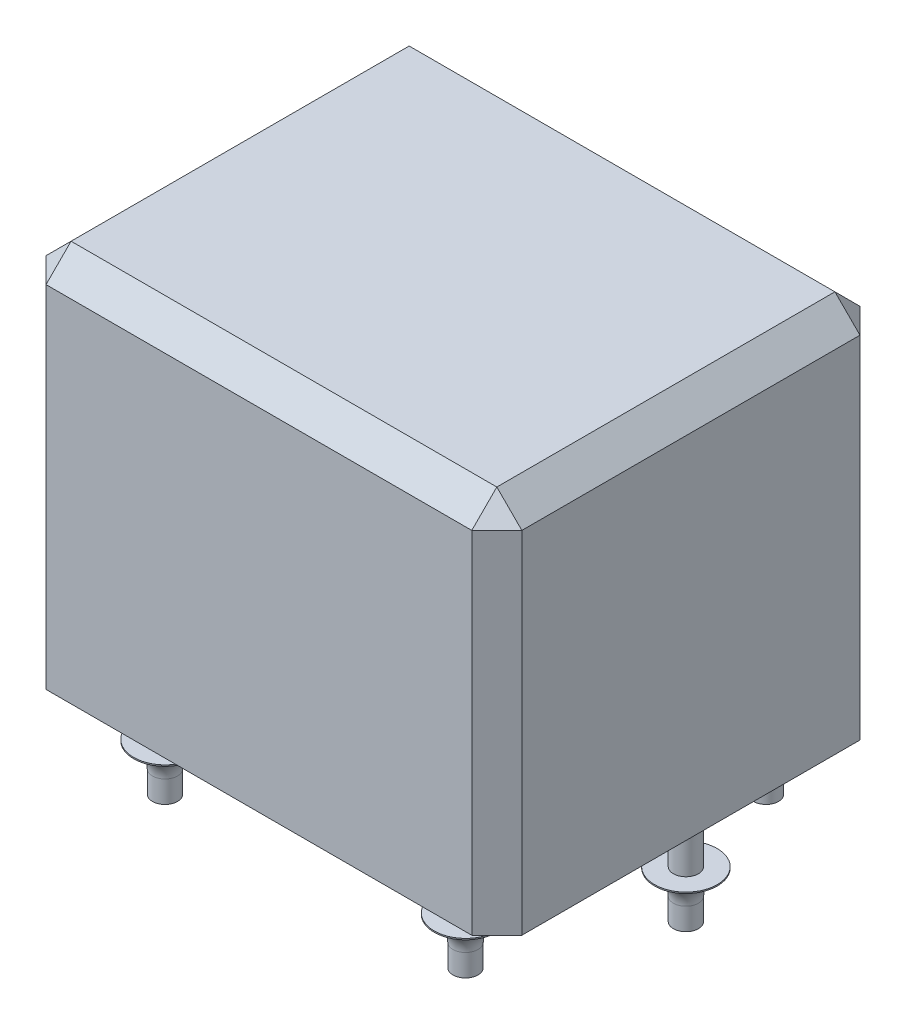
ISO-10303-21;
HEADER;
FILE_DESCRIPTION(('STEP AP214'),'2;1');
FILE_NAME('part.step','',(''),(''),'','','');
FILE_SCHEMA(('AUTOMOTIVE_DESIGN { 1 0 10303 214 1 1 1 1 }'));
ENDSEC;
DATA;
#1=APPLICATION_CONTEXT('core data for automotive mechanical design processes');
#2=APPLICATION_PROTOCOL_DEFINITION('international standard','automotive_design',2000,#1);
#3=PRODUCT_CONTEXT('',#1,'mechanical');
#4=PRODUCT('Part','Part','',(#3));
#5=PRODUCT_RELATED_PRODUCT_CATEGORY('part','',(#4));
#6=PRODUCT_DEFINITION_FORMATION('','',#4);
#7=PRODUCT_DEFINITION_CONTEXT('part definition',#1,'design');
#8=PRODUCT_DEFINITION('design','',#6,#7);
#9=PRODUCT_DEFINITION_SHAPE('','',#8);
#10=(LENGTH_UNIT() NAMED_UNIT(*) SI_UNIT(.MILLI.,.METRE.));
#11=(NAMED_UNIT(*) PLANE_ANGLE_UNIT() SI_UNIT($,.RADIAN.));
#12=(NAMED_UNIT(*) SI_UNIT($,.STERADIAN.) SOLID_ANGLE_UNIT());
#13=UNCERTAINTY_MEASURE_WITH_UNIT(LENGTH_MEASURE(1.E-05),#10,'distance_accuracy_value','');
#14=(GEOMETRIC_REPRESENTATION_CONTEXT(3) GLOBAL_UNCERTAINTY_ASSIGNED_CONTEXT((#13)) GLOBAL_UNIT_ASSIGNED_CONTEXT((#10,
#11,#12)) REPRESENTATION_CONTEXT('',''));
#15=CARTESIAN_POINT('',(0.,0.,0.));
#16=DIRECTION('',(0.,0.,1.));
#17=DIRECTION('',(1.,0.,0.));
#18=AXIS2_PLACEMENT_3D('',#15,#16,#17);
#19=CARTESIAN_POINT('',(8.8,-3.5,-0.5));
#20=DIRECTION('',(0.,1.,0.));
#21=DIRECTION('',(0.,0.,1.));
#22=AXIS2_PLACEMENT_3D('',#19,#20,#21);
#23=CYLINDRICAL_SURFACE('',#22,0.500000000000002);
#24=CARTESIAN_POINT('',(8.8,-2.61824583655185,-0.5));
#25=DIRECTION('',(0.,1.,0.));
#26=DIRECTION('',(0.,0.,1.));
#27=AXIS2_PLACEMENT_3D('',#24,#25,#26);
#28=CIRCLE('',#27,0.500000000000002);
#29=CARTESIAN_POINT('',(8.8,-2.61824583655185,0.));
#30=VERTEX_POINT('',#29);
#31=EDGE_CURVE('E11',#30,#30,#28,.F.);
#32=ORIENTED_EDGE('',*,*,#31,.T.);
#33=EDGE_LOOP('',(#32));
#34=FACE_BOUND('',#33,.T.);
#35=CARTESIAN_POINT('',(8.8,-3.5,-0.5));
#36=DIRECTION('',(0.,-1.,0.));
#37=DIRECTION('',(0.,0.,-1.));
#38=AXIS2_PLACEMENT_3D('',#35,#36,#37);
#39=CIRCLE('',#38,0.500000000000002);
#40=CARTESIAN_POINT('',(8.8,-3.5,-1.));
#41=VERTEX_POINT('',#40);
#42=EDGE_CURVE('E48',#41,#41,#39,.T.);
#43=ORIENTED_EDGE('',*,*,#42,.F.);
#44=EDGE_LOOP('',(#43));
#45=FACE_BOUND('',#44,.T.);
#46=ADVANCED_FACE('F41',(#34,#45),#23,.T.);
#47=CARTESIAN_POINT('',(8.8,-3.5,-0.5));
#48=DIRECTION('',(0.,-1.,0.));
#49=DIRECTION('',(0.,0.,-1.));
#50=AXIS2_PLACEMENT_3D('',#47,#48,#49);
#51=PLANE('',#50);
#52=ORIENTED_EDGE('',*,*,#42,.T.);
#53=EDGE_LOOP('',(#52));
#54=FACE_BOUND('',#53,.T.);
#55=ADVANCED_FACE('F86',(#54),#51,.T.);
#56=CARTESIAN_POINT('',(8.8,-1.6,-0.5));
#57=DIRECTION('',(0.,1.,0.));
#58=DIRECTION('',(0.,0.,1.));
#59=AXIS2_PLACEMENT_3D('',#56,#57,#58);
#60=PLANE('',#59);
#61=CARTESIAN_POINT('',(8.8,-1.6,-0.5));
#62=DIRECTION('',(0.,1.,0.));
#63=DIRECTION('',(0.,0.,1.));
#64=AXIS2_PLACEMENT_3D('',#61,#62,#63);
#65=CIRCLE('',#64,1.25);
#66=CARTESIAN_POINT('',(8.8,-1.6,0.75));
#67=VERTEX_POINT('',#66);
#68=EDGE_CURVE('E60',#67,#67,#65,.T.);
#69=ORIENTED_EDGE('',*,*,#68,.T.);
#70=EDGE_LOOP('',(#69));
#71=FACE_BOUND('',#70,.T.);
#72=CARTESIAN_POINT('',(8.8,-1.6,-0.5));
#73=DIRECTION('',(0.,1.,0.));
#74=DIRECTION('',(0.,0.,1.));
#75=AXIS2_PLACEMENT_3D('',#72,#73,#74);
#76=CIRCLE('',#75,0.500000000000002);
#77=CARTESIAN_POINT('',(8.8,-1.6,0.));
#78=VERTEX_POINT('',#77);
#79=EDGE_CURVE('E57',#78,#78,#76,.T.);
#80=ORIENTED_EDGE('',*,*,#79,.F.);
#81=EDGE_LOOP('',(#80));
#82=FACE_BOUND('',#81,.T.);
#83=ADVANCED_FACE('F72',(#71,#82),#60,.T.);
#84=CARTESIAN_POINT('',(8.8,-1.65,-0.5));
#85=DIRECTION('',(0.,1.,0.));
#86=DIRECTION('',(0.,0.,1.));
#87=AXIS2_PLACEMENT_3D('',#84,#85,#86);
#88=CYLINDRICAL_SURFACE('',#87,1.25);
#89=CARTESIAN_POINT('',(8.8,-1.65,-0.5));
#90=DIRECTION('',(0.,1.,0.));
#91=DIRECTION('',(0.,0.,1.));
#92=AXIS2_PLACEMENT_3D('',#89,#90,#91);
#93=CIRCLE('',#92,1.25);
#94=CARTESIAN_POINT('',(8.8,-1.65,0.75));
#95=VERTEX_POINT('',#94);
#96=EDGE_CURVE('E63',#95,#95,#93,.T.);
#97=ORIENTED_EDGE('',*,*,#96,.T.);
#98=EDGE_LOOP('',(#97));
#99=FACE_BOUND('',#98,.T.);
#100=ORIENTED_EDGE('',*,*,#68,.F.);
#101=EDGE_LOOP('',(#100));
#102=FACE_BOUND('',#101,.T.);
#103=ADVANCED_FACE('F75',(#99,#102),#88,.T.);
#104=CARTESIAN_POINT('',(8.8,0.,-0.5));
#105=DIRECTION('',(0.,-1.,0.));
#106=DIRECTION('',(0.,0.,-1.));
#107=AXIS2_PLACEMENT_3D('',#104,#105,#106);
#108=PLANE('',#107);
#109=CARTESIAN_POINT('',(8.8,0.,-0.5));
#110=DIRECTION('',(0.,-1.,0.));
#111=DIRECTION('',(0.,0.,-1.));
#112=AXIS2_PLACEMENT_3D('',#109,#110,#111);
#113=CIRCLE('',#112,0.500000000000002);
#114=CARTESIAN_POINT('',(8.8,0.,-1.));
#115=VERTEX_POINT('',#114);
#116=EDGE_CURVE('E52',#115,#115,#113,.T.);
#117=ORIENTED_EDGE('',*,*,#116,.F.);
#118=EDGE_LOOP('',(#117));
#119=FACE_BOUND('',#118,.T.);
#120=ADVANCED_FACE('F77',(#119),#108,.F.);
#121=ORIENTED_EDGE('',*,*,#79,.T.);
#122=EDGE_LOOP('',(#121));
#123=FACE_BOUND('',#122,.T.);
#124=ORIENTED_EDGE('',*,*,#116,.T.);
#125=EDGE_LOOP('',(#124));
#126=FACE_BOUND('',#125,.T.);
#127=ADVANCED_FACE('F83',(#123,#126),#23,.T.);
#128=CARTESIAN_POINT('',(8.8,-2.61824583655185,-0.5));
#129=DIRECTION('',(0.,1.,0.));
#130=DIRECTION('',(0.,0.,1.));
#131=AXIS2_PLACEMENT_3D('',#128,#129,#130);
#132=TOROIDAL_SURFACE('',#131,1.5,1.);
#133=ORIENTED_EDGE('',*,*,#31,.F.);
#134=EDGE_LOOP('',(#133));
#135=FACE_BOUND('',#134,.T.);
#136=ORIENTED_EDGE('',*,*,#96,.F.);
#137=EDGE_LOOP('',(#136));
#138=FACE_BOUND('',#137,.T.);
#139=ADVANCED_FACE('F43',(#135,#138),#132,.F.);
#140=CLOSED_SHELL('',(#46,#55,#83,#103,#120,#127,#139));
#141=MANIFOLD_SOLID_BREP('B2',#140);
#142=CARTESIAN_POINT('',(-6.,-3.5,-6.5));
#143=DIRECTION('',(0.,1.,0.));
#144=DIRECTION('',(0.,0.,1.));
#145=AXIS2_PLACEMENT_3D('',#142,#143,#144);
#146=CYLINDRICAL_SURFACE('',#145,0.500000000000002);
#147=CARTESIAN_POINT('',(-6.,-2.61824583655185,-6.5));
#148=DIRECTION('',(0.,1.,0.));
#149=DIRECTION('',(0.,0.,1.));
#150=AXIS2_PLACEMENT_3D('',#147,#148,#149);
#151=CIRCLE('',#150,0.500000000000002);
#152=CARTESIAN_POINT('',(-6.,-2.61824583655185,-6.));
#153=VERTEX_POINT('',#152);
#154=EDGE_CURVE('E40',#153,#153,#151,.F.);
#155=ORIENTED_EDGE('',*,*,#154,.T.);
#156=EDGE_LOOP('',(#155));
#157=FACE_BOUND('',#156,.T.);
#158=CARTESIAN_POINT('',(-6.,-3.5,-6.5));
#159=DIRECTION('',(0.,-1.,0.));
#160=DIRECTION('',(0.,0.,-1.));
#161=AXIS2_PLACEMENT_3D('',#158,#159,#160);
#162=CIRCLE('',#161,0.500000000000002);
#163=CARTESIAN_POINT('',(-6.,-3.5,-7.));
#164=VERTEX_POINT('',#163);
#165=EDGE_CURVE('E155',#164,#164,#162,.T.);
#166=ORIENTED_EDGE('',*,*,#165,.F.);
#167=EDGE_LOOP('',(#166));
#168=FACE_BOUND('',#167,.T.);
#169=ADVANCED_FACE('F148',(#157,#168),#146,.T.);
#170=CARTESIAN_POINT('',(-6.,-3.5,-6.5));
#171=DIRECTION('',(0.,-1.,0.));
#172=DIRECTION('',(0.,0.,-1.));
#173=AXIS2_PLACEMENT_3D('',#170,#171,#172);
#174=PLANE('',#173);
#175=ORIENTED_EDGE('',*,*,#165,.T.);
#176=EDGE_LOOP('',(#175));
#177=FACE_BOUND('',#176,.T.);
#178=ADVANCED_FACE('F193',(#177),#174,.T.);
#179=CARTESIAN_POINT('',(-6.,-1.6,-6.5));
#180=DIRECTION('',(0.,1.,0.));
#181=DIRECTION('',(0.,0.,1.));
#182=AXIS2_PLACEMENT_3D('',#179,#180,#181);
#183=PLANE('',#182);
#184=CARTESIAN_POINT('',(-6.,-1.6,-6.5));
#185=DIRECTION('',(0.,1.,0.));
#186=DIRECTION('',(0.,0.,1.));
#187=AXIS2_PLACEMENT_3D('',#184,#185,#186);
#188=CIRCLE('',#187,1.25);
#189=CARTESIAN_POINT('',(-6.,-1.6,-5.25));
#190=VERTEX_POINT('',#189);
#191=EDGE_CURVE('E167',#190,#190,#188,.T.);
#192=ORIENTED_EDGE('',*,*,#191,.T.);
#193=EDGE_LOOP('',(#192));
#194=FACE_BOUND('',#193,.T.);
#195=CARTESIAN_POINT('',(-6.,-1.6,-6.5));
#196=DIRECTION('',(0.,1.,0.));
#197=DIRECTION('',(0.,0.,1.));
#198=AXIS2_PLACEMENT_3D('',#195,#196,#197);
#199=CIRCLE('',#198,0.500000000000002);
#200=CARTESIAN_POINT('',(-6.,-1.6,-6.));
#201=VERTEX_POINT('',#200);
#202=EDGE_CURVE('E164',#201,#201,#199,.T.);
#203=ORIENTED_EDGE('',*,*,#202,.F.);
#204=EDGE_LOOP('',(#203));
#205=FACE_BOUND('',#204,.T.);
#206=ADVANCED_FACE('F179',(#194,#205),#183,.T.);
#207=CARTESIAN_POINT('',(-6.,-1.65,-6.5));
#208=DIRECTION('',(0.,1.,0.));
#209=DIRECTION('',(0.,0.,1.));
#210=AXIS2_PLACEMENT_3D('',#207,#208,#209);
#211=CYLINDRICAL_SURFACE('',#210,1.25);
#212=CARTESIAN_POINT('',(-6.,-1.65,-6.5));
#213=DIRECTION('',(0.,1.,0.));
#214=DIRECTION('',(0.,0.,1.));
#215=AXIS2_PLACEMENT_3D('',#212,#213,#214);
#216=CIRCLE('',#215,1.25);
#217=CARTESIAN_POINT('',(-6.,-1.65,-5.25));
#218=VERTEX_POINT('',#217);
#219=EDGE_CURVE('E170',#218,#218,#216,.T.);
#220=ORIENTED_EDGE('',*,*,#219,.T.);
#221=EDGE_LOOP('',(#220));
#222=FACE_BOUND('',#221,.T.);
#223=ORIENTED_EDGE('',*,*,#191,.F.);
#224=EDGE_LOOP('',(#223));
#225=FACE_BOUND('',#224,.T.);
#226=ADVANCED_FACE('F182',(#222,#225),#211,.T.);
#227=CARTESIAN_POINT('',(-6.,0.,-6.5));
#228=DIRECTION('',(0.,-1.,0.));
#229=DIRECTION('',(0.,0.,-1.));
#230=AXIS2_PLACEMENT_3D('',#227,#228,#229);
#231=PLANE('',#230);
#232=CARTESIAN_POINT('',(-6.,0.,-6.5));
#233=DIRECTION('',(0.,-1.,0.));
#234=DIRECTION('',(0.,0.,-1.));
#235=AXIS2_PLACEMENT_3D('',#232,#233,#234);
#236=CIRCLE('',#235,0.500000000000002);
#237=CARTESIAN_POINT('',(-6.,0.,-7.));
#238=VERTEX_POINT('',#237);
#239=EDGE_CURVE('E159',#238,#238,#236,.T.);
#240=ORIENTED_EDGE('',*,*,#239,.F.);
#241=EDGE_LOOP('',(#240));
#242=FACE_BOUND('',#241,.T.);
#243=ADVANCED_FACE('F184',(#242),#231,.F.);
#244=ORIENTED_EDGE('',*,*,#202,.T.);
#245=EDGE_LOOP('',(#244));
#246=FACE_BOUND('',#245,.T.);
#247=ORIENTED_EDGE('',*,*,#239,.T.);
#248=EDGE_LOOP('',(#247));
#249=FACE_BOUND('',#248,.T.);
#250=ADVANCED_FACE('F190',(#246,#249),#146,.T.);
#251=CARTESIAN_POINT('',(-6.,-2.61824583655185,-6.5));
#252=DIRECTION('',(0.,1.,0.));
#253=DIRECTION('',(0.,0.,1.));
#254=AXIS2_PLACEMENT_3D('',#251,#252,#253);
#255=TOROIDAL_SURFACE('',#254,1.5,1.);
#256=ORIENTED_EDGE('',*,*,#154,.F.);
#257=EDGE_LOOP('',(#256));
#258=FACE_BOUND('',#257,.T.);
#259=ORIENTED_EDGE('',*,*,#219,.F.);
#260=EDGE_LOOP('',(#259));
#261=FACE_BOUND('',#260,.T.);
#262=ADVANCED_FACE('F150',(#258,#261),#255,.F.);
#263=CLOSED_SHELL('',(#169,#178,#206,#226,#243,#250,#262));
#264=MANIFOLD_SOLID_BREP('B6',#263);
#265=CARTESIAN_POINT('',(6.,-3.5,-6.5));
#266=DIRECTION('',(0.,1.,0.));
#267=DIRECTION('',(0.,0.,1.));
#268=AXIS2_PLACEMENT_3D('',#265,#266,#267);
#269=CYLINDRICAL_SURFACE('',#268,0.500000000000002);
#270=CARTESIAN_POINT('',(6.,-2.61824583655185,-6.5));
#271=DIRECTION('',(0.,1.,0.));
#272=DIRECTION('',(0.,0.,1.));
#273=AXIS2_PLACEMENT_3D('',#270,#271,#272);
#274=CIRCLE('',#273,0.500000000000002);
#275=CARTESIAN_POINT('',(6.,-2.61824583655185,-6.));
#276=VERTEX_POINT('',#275);
#277=EDGE_CURVE('E147',#276,#276,#274,.F.);
#278=ORIENTED_EDGE('',*,*,#277,.T.);
#279=EDGE_LOOP('',(#278));
#280=FACE_BOUND('',#279,.T.);
#281=CARTESIAN_POINT('',(6.,-3.5,-6.5));
#282=DIRECTION('',(0.,-1.,0.));
#283=DIRECTION('',(0.,0.,-1.));
#284=AXIS2_PLACEMENT_3D('',#281,#282,#283);
#285=CIRCLE('',#284,0.500000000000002);
#286=CARTESIAN_POINT('',(6.,-3.5,-7.));
#287=VERTEX_POINT('',#286);
#288=EDGE_CURVE('E262',#287,#287,#285,.T.);
#289=ORIENTED_EDGE('',*,*,#288,.F.);
#290=EDGE_LOOP('',(#289));
#291=FACE_BOUND('',#290,.T.);
#292=ADVANCED_FACE('F255',(#280,#291),#269,.T.);
#293=CARTESIAN_POINT('',(6.,-3.5,-6.5));
#294=DIRECTION('',(0.,-1.,0.));
#295=DIRECTION('',(0.,0.,-1.));
#296=AXIS2_PLACEMENT_3D('',#293,#294,#295);
#297=PLANE('',#296);
#298=ORIENTED_EDGE('',*,*,#288,.T.);
#299=EDGE_LOOP('',(#298));
#300=FACE_BOUND('',#299,.T.);
#301=ADVANCED_FACE('F300',(#300),#297,.T.);
#302=CARTESIAN_POINT('',(6.,-1.6,-6.5));
#303=DIRECTION('',(0.,1.,0.));
#304=DIRECTION('',(0.,0.,1.));
#305=AXIS2_PLACEMENT_3D('',#302,#303,#304);
#306=PLANE('',#305);
#307=CARTESIAN_POINT('',(6.,-1.6,-6.5));
#308=DIRECTION('',(0.,1.,0.));
#309=DIRECTION('',(0.,0.,1.));
#310=AXIS2_PLACEMENT_3D('',#307,#308,#309);
#311=CIRCLE('',#310,1.25);
#312=CARTESIAN_POINT('',(6.,-1.6,-5.25));
#313=VERTEX_POINT('',#312);
#314=EDGE_CURVE('E274',#313,#313,#311,.T.);
#315=ORIENTED_EDGE('',*,*,#314,.T.);
#316=EDGE_LOOP('',(#315));
#317=FACE_BOUND('',#316,.T.);
#318=CARTESIAN_POINT('',(6.,-1.6,-6.5));
#319=DIRECTION('',(0.,1.,0.));
#320=DIRECTION('',(0.,0.,1.));
#321=AXIS2_PLACEMENT_3D('',#318,#319,#320);
#322=CIRCLE('',#321,0.500000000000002);
#323=CARTESIAN_POINT('',(6.,-1.6,-6.));
#324=VERTEX_POINT('',#323);
#325=EDGE_CURVE('E271',#324,#324,#322,.T.);
#326=ORIENTED_EDGE('',*,*,#325,.F.);
#327=EDGE_LOOP('',(#326));
#328=FACE_BOUND('',#327,.T.);
#329=ADVANCED_FACE('F286',(#317,#328),#306,.T.);
#330=CARTESIAN_POINT('',(6.,-1.65,-6.5));
#331=DIRECTION('',(0.,1.,0.));
#332=DIRECTION('',(0.,0.,1.));
#333=AXIS2_PLACEMENT_3D('',#330,#331,#332);
#334=CYLINDRICAL_SURFACE('',#333,1.25);
#335=CARTESIAN_POINT('',(6.,-1.65,-6.5));
#336=DIRECTION('',(0.,1.,0.));
#337=DIRECTION('',(0.,0.,1.));
#338=AXIS2_PLACEMENT_3D('',#335,#336,#337);
#339=CIRCLE('',#338,1.25);
#340=CARTESIAN_POINT('',(6.,-1.65,-5.25));
#341=VERTEX_POINT('',#340);
#342=EDGE_CURVE('E277',#341,#341,#339,.T.);
#343=ORIENTED_EDGE('',*,*,#342,.T.);
#344=EDGE_LOOP('',(#343));
#345=FACE_BOUND('',#344,.T.);
#346=ORIENTED_EDGE('',*,*,#314,.F.);
#347=EDGE_LOOP('',(#346));
#348=FACE_BOUND('',#347,.T.);
#349=ADVANCED_FACE('F289',(#345,#348),#334,.T.);
#350=CARTESIAN_POINT('',(6.,0.,-6.5));
#351=DIRECTION('',(0.,-1.,0.));
#352=DIRECTION('',(0.,0.,-1.));
#353=AXIS2_PLACEMENT_3D('',#350,#351,#352);
#354=PLANE('',#353);
#355=CARTESIAN_POINT('',(6.,0.,-6.5));
#356=DIRECTION('',(0.,-1.,0.));
#357=DIRECTION('',(0.,0.,-1.));
#358=AXIS2_PLACEMENT_3D('',#355,#356,#357);
#359=CIRCLE('',#358,0.500000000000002);
#360=CARTESIAN_POINT('',(6.,0.,-7.));
#361=VERTEX_POINT('',#360);
#362=EDGE_CURVE('E266',#361,#361,#359,.T.);
#363=ORIENTED_EDGE('',*,*,#362,.F.);
#364=EDGE_LOOP('',(#363));
#365=FACE_BOUND('',#364,.T.);
#366=ADVANCED_FACE('F291',(#365),#354,.F.);
#367=ORIENTED_EDGE('',*,*,#325,.T.);
#368=EDGE_LOOP('',(#367));
#369=FACE_BOUND('',#368,.T.);
#370=ORIENTED_EDGE('',*,*,#362,.T.);
#371=EDGE_LOOP('',(#370));
#372=FACE_BOUND('',#371,.T.);
#373=ADVANCED_FACE('F297',(#369,#372),#269,.T.);
#374=CARTESIAN_POINT('',(6.,-2.61824583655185,-6.5));
#375=DIRECTION('',(0.,1.,0.));
#376=DIRECTION('',(0.,0.,1.));
#377=AXIS2_PLACEMENT_3D('',#374,#375,#376);
#378=TOROIDAL_SURFACE('',#377,1.5,1.);
#379=ORIENTED_EDGE('',*,*,#277,.F.);
#380=EDGE_LOOP('',(#379));
#381=FACE_BOUND('',#380,.T.);
#382=ORIENTED_EDGE('',*,*,#342,.F.);
#383=EDGE_LOOP('',(#382));
#384=FACE_BOUND('',#383,.T.);
#385=ADVANCED_FACE('F257',(#381,#384),#378,.F.);
#386=CLOSED_SHELL('',(#292,#301,#329,#349,#366,#373,#385));
#387=MANIFOLD_SOLID_BREP('B35',#386);
#388=CARTESIAN_POINT('',(-6.,-3.5,5.5));
#389=DIRECTION('',(0.,1.,0.));
#390=DIRECTION('',(0.,0.,1.));
#391=AXIS2_PLACEMENT_3D('',#388,#389,#390);
#392=CYLINDRICAL_SURFACE('',#391,0.500000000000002);
#393=CARTESIAN_POINT('',(-6.,-2.61824583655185,5.5));
#394=DIRECTION('',(0.,1.,0.));
#395=DIRECTION('',(0.,0.,1.));
#396=AXIS2_PLACEMENT_3D('',#393,#394,#395);
#397=CIRCLE('',#396,0.500000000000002);
#398=CARTESIAN_POINT('',(-6.,-2.61824583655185,6.));
#399=VERTEX_POINT('',#398);
#400=EDGE_CURVE('E254',#399,#399,#397,.F.);
#401=ORIENTED_EDGE('',*,*,#400,.T.);
#402=EDGE_LOOP('',(#401));
#403=FACE_BOUND('',#402,.T.);
#404=CARTESIAN_POINT('',(-6.,-3.5,5.5));
#405=DIRECTION('',(0.,-1.,0.));
#406=DIRECTION('',(0.,0.,-1.));
#407=AXIS2_PLACEMENT_3D('',#404,#405,#406);
#408=CIRCLE('',#407,0.500000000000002);
#409=CARTESIAN_POINT('',(-6.,-3.5,5.));
#410=VERTEX_POINT('',#409);
#411=EDGE_CURVE('E369',#410,#410,#408,.T.);
#412=ORIENTED_EDGE('',*,*,#411,.F.);
#413=EDGE_LOOP('',(#412));
#414=FACE_BOUND('',#413,.T.);
#415=ADVANCED_FACE('F362',(#403,#414),#392,.T.);
#416=CARTESIAN_POINT('',(-6.,-3.5,5.5));
#417=DIRECTION('',(0.,-1.,0.));
#418=DIRECTION('',(0.,0.,-1.));
#419=AXIS2_PLACEMENT_3D('',#416,#417,#418);
#420=PLANE('',#419);
#421=ORIENTED_EDGE('',*,*,#411,.T.);
#422=EDGE_LOOP('',(#421));
#423=FACE_BOUND('',#422,.T.);
#424=ADVANCED_FACE('F407',(#423),#420,.T.);
#425=CARTESIAN_POINT('',(-6.,-1.6,5.5));
#426=DIRECTION('',(0.,1.,0.));
#427=DIRECTION('',(0.,0.,1.));
#428=AXIS2_PLACEMENT_3D('',#425,#426,#427);
#429=PLANE('',#428);
#430=CARTESIAN_POINT('',(-6.,-1.6,5.5));
#431=DIRECTION('',(0.,1.,0.));
#432=DIRECTION('',(0.,0.,1.));
#433=AXIS2_PLACEMENT_3D('',#430,#431,#432);
#434=CIRCLE('',#433,1.25);
#435=CARTESIAN_POINT('',(-6.,-1.6,6.75));
#436=VERTEX_POINT('',#435);
#437=EDGE_CURVE('E381',#436,#436,#434,.T.);
#438=ORIENTED_EDGE('',*,*,#437,.T.);
#439=EDGE_LOOP('',(#438));
#440=FACE_BOUND('',#439,.T.);
#441=CARTESIAN_POINT('',(-6.,-1.6,5.5));
#442=DIRECTION('',(0.,1.,0.));
#443=DIRECTION('',(0.,0.,1.));
#444=AXIS2_PLACEMENT_3D('',#441,#442,#443);
#445=CIRCLE('',#444,0.500000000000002);
#446=CARTESIAN_POINT('',(-6.,-1.6,6.));
#447=VERTEX_POINT('',#446);
#448=EDGE_CURVE('E378',#447,#447,#445,.T.);
#449=ORIENTED_EDGE('',*,*,#448,.F.);
#450=EDGE_LOOP('',(#449));
#451=FACE_BOUND('',#450,.T.);
#452=ADVANCED_FACE('F393',(#440,#451),#429,.T.);
#453=CARTESIAN_POINT('',(-6.,-1.65,5.5));
#454=DIRECTION('',(0.,1.,0.));
#455=DIRECTION('',(0.,0.,1.));
#456=AXIS2_PLACEMENT_3D('',#453,#454,#455);
#457=CYLINDRICAL_SURFACE('',#456,1.25);
#458=CARTESIAN_POINT('',(-6.,-1.65,5.5));
#459=DIRECTION('',(0.,1.,0.));
#460=DIRECTION('',(0.,0.,1.));
#461=AXIS2_PLACEMENT_3D('',#458,#459,#460);
#462=CIRCLE('',#461,1.25);
#463=CARTESIAN_POINT('',(-6.,-1.65,6.75));
#464=VERTEX_POINT('',#463);
#465=EDGE_CURVE('E384',#464,#464,#462,.T.);
#466=ORIENTED_EDGE('',*,*,#465,.T.);
#467=EDGE_LOOP('',(#466));
#468=FACE_BOUND('',#467,.T.);
#469=ORIENTED_EDGE('',*,*,#437,.F.);
#470=EDGE_LOOP('',(#469));
#471=FACE_BOUND('',#470,.T.);
#472=ADVANCED_FACE('F396',(#468,#471),#457,.T.);
#473=CARTESIAN_POINT('',(-6.,0.,5.5));
#474=DIRECTION('',(0.,-1.,0.));
#475=DIRECTION('',(0.,0.,-1.));
#476=AXIS2_PLACEMENT_3D('',#473,#474,#475);
#477=PLANE('',#476);
#478=CARTESIAN_POINT('',(-6.,0.,5.5));
#479=DIRECTION('',(0.,-1.,0.));
#480=DIRECTION('',(0.,0.,-1.));
#481=AXIS2_PLACEMENT_3D('',#478,#479,#480);
#482=CIRCLE('',#481,0.500000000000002);
#483=CARTESIAN_POINT('',(-6.,0.,5.));
#484=VERTEX_POINT('',#483);
#485=EDGE_CURVE('E373',#484,#484,#482,.T.);
#486=ORIENTED_EDGE('',*,*,#485,.F.);
#487=EDGE_LOOP('',(#486));
#488=FACE_BOUND('',#487,.T.);
#489=ADVANCED_FACE('F398',(#488),#477,.F.);
#490=ORIENTED_EDGE('',*,*,#448,.T.);
#491=EDGE_LOOP('',(#490));
#492=FACE_BOUND('',#491,.T.);
#493=ORIENTED_EDGE('',*,*,#485,.T.);
#494=EDGE_LOOP('',(#493));
#495=FACE_BOUND('',#494,.T.);
#496=ADVANCED_FACE('F404',(#492,#495),#392,.T.);
#497=CARTESIAN_POINT('',(-6.,-2.61824583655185,5.5));
#498=DIRECTION('',(0.,1.,0.));
#499=DIRECTION('',(0.,0.,1.));
#500=AXIS2_PLACEMENT_3D('',#497,#498,#499);
#501=TOROIDAL_SURFACE('',#500,1.5,1.);
#502=ORIENTED_EDGE('',*,*,#400,.F.);
#503=EDGE_LOOP('',(#502));
#504=FACE_BOUND('',#503,.T.);
#505=ORIENTED_EDGE('',*,*,#465,.F.);
#506=EDGE_LOOP('',(#505));
#507=FACE_BOUND('',#506,.T.);
#508=ADVANCED_FACE('F364',(#504,#507),#501,.F.);
#509=CLOSED_SHELL('',(#415,#424,#452,#472,#489,#496,#508));
#510=MANIFOLD_SOLID_BREP('B142',#509);
#511=CARTESIAN_POINT('',(6.,-3.5,5.5));
#512=DIRECTION('',(0.,1.,0.));
#513=DIRECTION('',(0.,0.,1.));
#514=AXIS2_PLACEMENT_3D('',#511,#512,#513);
#515=CYLINDRICAL_SURFACE('',#514,0.500000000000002);
#516=CARTESIAN_POINT('',(6.,-2.61824583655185,5.5));
#517=DIRECTION('',(0.,1.,0.));
#518=DIRECTION('',(0.,0.,1.));
#519=AXIS2_PLACEMENT_3D('',#516,#517,#518);
#520=CIRCLE('',#519,0.500000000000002);
#521=CARTESIAN_POINT('',(6.,-2.61824583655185,6.));
#522=VERTEX_POINT('',#521);
#523=EDGE_CURVE('E361',#522,#522,#520,.F.);
#524=ORIENTED_EDGE('',*,*,#523,.T.);
#525=EDGE_LOOP('',(#524));
#526=FACE_BOUND('',#525,.T.);
#527=CARTESIAN_POINT('',(6.,-3.5,5.5));
#528=DIRECTION('',(0.,-1.,0.));
#529=DIRECTION('',(0.,0.,-1.));
#530=AXIS2_PLACEMENT_3D('',#527,#528,#529);
#531=CIRCLE('',#530,0.500000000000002);
#532=CARTESIAN_POINT('',(6.,-3.5,5.));
#533=VERTEX_POINT('',#532);
#534=EDGE_CURVE('E477',#533,#533,#531,.T.);
#535=ORIENTED_EDGE('',*,*,#534,.F.);
#536=EDGE_LOOP('',(#535));
#537=FACE_BOUND('',#536,.T.);
#538=ADVANCED_FACE('F470',(#526,#537),#515,.T.);
#539=CARTESIAN_POINT('',(6.,-3.5,5.5));
#540=DIRECTION('',(0.,-1.,0.));
#541=DIRECTION('',(0.,0.,-1.));
#542=AXIS2_PLACEMENT_3D('',#539,#540,#541);
#543=PLANE('',#542);
#544=ORIENTED_EDGE('',*,*,#534,.T.);
#545=EDGE_LOOP('',(#544));
#546=FACE_BOUND('',#545,.T.);
#547=ADVANCED_FACE('F515',(#546),#543,.T.);
#548=CARTESIAN_POINT('',(6.,-1.6,5.5));
#549=DIRECTION('',(0.,1.,0.));
#550=DIRECTION('',(0.,0.,1.));
#551=AXIS2_PLACEMENT_3D('',#548,#549,#550);
#552=PLANE('',#551);
#553=CARTESIAN_POINT('',(6.,-1.6,5.5));
#554=DIRECTION('',(0.,1.,0.));
#555=DIRECTION('',(0.,0.,1.));
#556=AXIS2_PLACEMENT_3D('',#553,#554,#555);
#557=CIRCLE('',#556,1.25);
#558=CARTESIAN_POINT('',(6.,-1.6,6.75));
#559=VERTEX_POINT('',#558);
#560=EDGE_CURVE('E489',#559,#559,#557,.T.);
#561=ORIENTED_EDGE('',*,*,#560,.T.);
#562=EDGE_LOOP('',(#561));
#563=FACE_BOUND('',#562,.T.);
#564=CARTESIAN_POINT('',(6.,-1.6,5.5));
#565=DIRECTION('',(0.,1.,0.));
#566=DIRECTION('',(0.,0.,1.));
#567=AXIS2_PLACEMENT_3D('',#564,#565,#566);
#568=CIRCLE('',#567,0.500000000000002);
#569=CARTESIAN_POINT('',(6.,-1.6,6.));
#570=VERTEX_POINT('',#569);
#571=EDGE_CURVE('E486',#570,#570,#568,.T.);
#572=ORIENTED_EDGE('',*,*,#571,.F.);
#573=EDGE_LOOP('',(#572));
#574=FACE_BOUND('',#573,.T.);
#575=ADVANCED_FACE('F501',(#563,#574),#552,.T.);
#576=CARTESIAN_POINT('',(6.,-1.65,5.5));
#577=DIRECTION('',(0.,1.,0.));
#578=DIRECTION('',(0.,0.,1.));
#579=AXIS2_PLACEMENT_3D('',#576,#577,#578);
#580=CYLINDRICAL_SURFACE('',#579,1.25);
#581=CARTESIAN_POINT('',(6.,-1.65,5.5));
#582=DIRECTION('',(0.,1.,0.));
#583=DIRECTION('',(0.,0.,1.));
#584=AXIS2_PLACEMENT_3D('',#581,#582,#583);
#585=CIRCLE('',#584,1.25);
#586=CARTESIAN_POINT('',(6.,-1.65,6.75));
#587=VERTEX_POINT('',#586);
#588=EDGE_CURVE('E492',#587,#587,#585,.T.);
#589=ORIENTED_EDGE('',*,*,#588,.T.);
#590=EDGE_LOOP('',(#589));
#591=FACE_BOUND('',#590,.T.);
#592=ORIENTED_EDGE('',*,*,#560,.F.);
#593=EDGE_LOOP('',(#592));
#594=FACE_BOUND('',#593,.T.);
#595=ADVANCED_FACE('F504',(#591,#594),#580,.T.);
#596=CARTESIAN_POINT('',(6.,0.,5.5));
#597=DIRECTION('',(0.,-1.,0.));
#598=DIRECTION('',(0.,0.,-1.));
#599=AXIS2_PLACEMENT_3D('',#596,#597,#598);
#600=PLANE('',#599);
#601=CARTESIAN_POINT('',(6.,0.,5.5));
#602=DIRECTION('',(0.,-1.,0.));
#603=DIRECTION('',(0.,0.,-1.));
#604=AXIS2_PLACEMENT_3D('',#601,#602,#603);
#605=CIRCLE('',#604,0.500000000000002);
#606=CARTESIAN_POINT('',(6.,0.,5.));
#607=VERTEX_POINT('',#606);
#608=EDGE_CURVE('E481',#607,#607,#605,.T.);
#609=ORIENTED_EDGE('',*,*,#608,.F.);
#610=EDGE_LOOP('',(#609));
#611=FACE_BOUND('',#610,.T.);
#612=ADVANCED_FACE('F506',(#611),#600,.F.);
#613=ORIENTED_EDGE('',*,*,#571,.T.);
#614=EDGE_LOOP('',(#613));
#615=FACE_BOUND('',#614,.T.);
#616=ORIENTED_EDGE('',*,*,#608,.T.);
#617=EDGE_LOOP('',(#616));
#618=FACE_BOUND('',#617,.T.);
#619=ADVANCED_FACE('F512',(#615,#618),#515,.T.);
#620=CARTESIAN_POINT('',(6.,-2.61824583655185,5.5));
#621=DIRECTION('',(0.,1.,0.));
#622=DIRECTION('',(0.,0.,1.));
#623=AXIS2_PLACEMENT_3D('',#620,#621,#622);
#624=TOROIDAL_SURFACE('',#623,1.5,1.);
#625=ORIENTED_EDGE('',*,*,#523,.F.);
#626=EDGE_LOOP('',(#625));
#627=FACE_BOUND('',#626,.T.);
#628=ORIENTED_EDGE('',*,*,#588,.F.);
#629=EDGE_LOOP('',(#628));
#630=FACE_BOUND('',#629,.T.);
#631=ADVANCED_FACE('F472',(#627,#630),#624,.F.);
#632=CLOSED_SHELL('',(#538,#547,#575,#595,#612,#619,#631));
#633=MANIFOLD_SOLID_BREP('B249',#632);
#634=CARTESIAN_POINT('',(9.50000000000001,15.,7.75));
#635=DIRECTION('',(-1.,0.,0.));
#636=DIRECTION('',(0.,-1.,0.));
#637=AXIS2_PLACEMENT_3D('',#634,#635,#636);
#638=PLANE('',#637);
#639=DIRECTION('',(0.,0.,1.));
#640=VECTOR('',#639,1.);
#641=CARTESIAN_POINT('',(9.50000000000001,14.,7.75));
#642=LINE('',#641,#640);
#643=CARTESIAN_POINT('',(9.50000000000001,14.,-6.75));
#644=VERTEX_POINT('',#643);
#645=CARTESIAN_POINT('',(9.50000000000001,14.,6.74999999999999));
#646=VERTEX_POINT('',#645);
#647=EDGE_CURVE('E710',#644,#646,#642,.T.);
#648=ORIENTED_EDGE('',*,*,#647,.T.);
#649=DIRECTION('',(0.,-1.,0.));
#650=VECTOR('',#649,1.);
#651=CARTESIAN_POINT('',(9.49999999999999,0.,6.74999999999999));
#652=LINE('',#651,#650);
#653=CARTESIAN_POINT('',(9.49999999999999,0.,6.74999999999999));
#654=VERTEX_POINT('',#653);
#655=EDGE_CURVE('E713',#646,#654,#652,.T.);
#656=ORIENTED_EDGE('',*,*,#655,.T.);
#657=DIRECTION('',(0.,0.,-1.));
#658=VECTOR('',#657,1.);
#659=CARTESIAN_POINT('',(9.49999999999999,0.,7.75));
#660=LINE('',#659,#658);
#661=CARTESIAN_POINT('',(9.49999999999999,0.,-6.74999999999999));
#662=VERTEX_POINT('',#661);
#663=EDGE_CURVE('E699',#654,#662,#660,.T.);
#664=ORIENTED_EDGE('',*,*,#663,.T.);
#665=DIRECTION('',(0.,1.,0.));
#666=VECTOR('',#665,1.);
#667=CARTESIAN_POINT('',(9.50000000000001,15.,-6.75));
#668=LINE('',#667,#666);
#669=EDGE_CURVE('E708',#662,#644,#668,.T.);
#670=ORIENTED_EDGE('',*,*,#669,.T.);
#671=EDGE_LOOP('',(#648,#656,#664,#670));
#672=FACE_BOUND('',#671,.T.);
#673=ADVANCED_FACE('F569',(#672),#638,.F.);
#674=CARTESIAN_POINT('',(-9.49999999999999,15.,7.75));
#675=DIRECTION('',(0.,-1.,0.));
#676=DIRECTION('',(0.,0.,-1.));
#677=AXIS2_PLACEMENT_3D('',#674,#675,#676);
#678=PLANE('',#677);
#679=DIRECTION('',(1.,0.,0.));
#680=VECTOR('',#679,1.);
#681=CARTESIAN_POINT('',(9.50000000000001,15.,6.74999999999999));
#682=LINE('',#681,#680);
#683=CARTESIAN_POINT('',(-8.49999999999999,15.,6.74999999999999));
#684=VERTEX_POINT('',#683);
#685=CARTESIAN_POINT('',(8.5,15.,6.74999999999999));
#686=VERTEX_POINT('',#685);
#687=EDGE_CURVE('E655',#684,#686,#682,.T.);
#688=ORIENTED_EDGE('',*,*,#687,.T.);
#689=DIRECTION('',(0.,0.,-1.));
#690=VECTOR('',#689,1.);
#691=CARTESIAN_POINT('',(8.5,15.,7.75));
#692=LINE('',#691,#690);
#693=CARTESIAN_POINT('',(8.5,15.,-6.75));
#694=VERTEX_POINT('',#693);
#695=EDGE_CURVE('E651',#686,#694,#692,.T.);
#696=ORIENTED_EDGE('',*,*,#695,.T.);
#697=DIRECTION('',(-1.,0.,0.));
#698=VECTOR('',#697,1.);
#699=CARTESIAN_POINT('',(-9.49999999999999,15.,-6.75));
#700=LINE('',#699,#698);
#701=CARTESIAN_POINT('',(-8.49999999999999,15.,-6.75));
#702=VERTEX_POINT('',#701);
#703=EDGE_CURVE('E645',#694,#702,#700,.T.);
#704=ORIENTED_EDGE('',*,*,#703,.T.);
#705=DIRECTION('',(0.,0.,1.));
#706=VECTOR('',#705,1.);
#707=CARTESIAN_POINT('',(-8.49999999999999,15.,7.75));
#708=LINE('',#707,#706);
#709=EDGE_CURVE('E648',#702,#684,#708,.T.);
#710=ORIENTED_EDGE('',*,*,#709,.T.);
#711=EDGE_LOOP('',(#688,#696,#704,#710));
#712=FACE_BOUND('',#711,.T.);
#713=ADVANCED_FACE('F647',(#712),#678,.F.);
#714=CARTESIAN_POINT('',(-9.49999999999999,15.,7.75));
#715=DIRECTION('',(1.,0.,0.));
#716=DIRECTION('',(0.,1.,0.));
#717=AXIS2_PLACEMENT_3D('',#714,#715,#716);
#718=PLANE('',#717);
#719=DIRECTION('',(0.,0.,-1.));
#720=VECTOR('',#719,1.);
#721=CARTESIAN_POINT('',(-9.49999999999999,14.,7.75));
#722=LINE('',#721,#720);
#723=CARTESIAN_POINT('',(-9.49999999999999,14.,6.74999999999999));
#724=VERTEX_POINT('',#723);
#725=CARTESIAN_POINT('',(-9.49999999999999,14.,-6.74999999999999));
#726=VERTEX_POINT('',#725);
#727=EDGE_CURVE('E578',#724,#726,#722,.T.);
#728=ORIENTED_EDGE('',*,*,#727,.T.);
#729=DIRECTION('',(0.,-1.,0.));
#730=VECTOR('',#729,1.);
#731=CARTESIAN_POINT('',(-9.49999999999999,15.,-6.74999999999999));
#732=LINE('',#731,#730);
#733=CARTESIAN_POINT('',(-9.49999999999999,0.,-6.74999999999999));
#734=VERTEX_POINT('',#733);
#735=EDGE_CURVE('E468',#726,#734,#732,.T.);
#736=ORIENTED_EDGE('',*,*,#735,.T.);
#737=DIRECTION('',(0.,0.,-1.));
#738=VECTOR('',#737,1.);
#739=CARTESIAN_POINT('',(-9.49999999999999,0.,7.75));
#740=LINE('',#739,#738);
#741=CARTESIAN_POINT('',(-9.49999999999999,0.,6.74999999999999));
#742=VERTEX_POINT('',#741);
#743=EDGE_CURVE('E666',#742,#734,#740,.T.);
#744=ORIENTED_EDGE('',*,*,#743,.F.);
#745=DIRECTION('',(0.,1.,0.));
#746=VECTOR('',#745,1.);
#747=CARTESIAN_POINT('',(-9.49999999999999,15.,6.74999999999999));
#748=LINE('',#747,#746);
#749=EDGE_CURVE('E589',#742,#724,#748,.T.);
#750=ORIENTED_EDGE('',*,*,#749,.T.);
#751=EDGE_LOOP('',(#728,#736,#744,#750));
#752=FACE_BOUND('',#751,.T.);
#753=ADVANCED_FACE('F781',(#752),#718,.F.);
#754=CARTESIAN_POINT('',(-9.49999999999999,0.,7.75));
#755=DIRECTION('',(0.,1.,0.));
#756=DIRECTION('',(0.,0.,1.));
#757=AXIS2_PLACEMENT_3D('',#754,#755,#756);
#758=PLANE('',#757);
#759=ORIENTED_EDGE('',*,*,#663,.F.);
#760=DIRECTION('',(-0.707106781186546,0.,0.707106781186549));
#761=VECTOR('',#760,1.);
#762=CARTESIAN_POINT('',(8.49999999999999,0.,7.75));
#763=LINE('',#762,#761);
#764=CARTESIAN_POINT('',(8.49999999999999,0.,7.75));
#765=VERTEX_POINT('',#764);
#766=EDGE_CURVE('E727',#654,#765,#763,.T.);
#767=ORIENTED_EDGE('',*,*,#766,.T.);
#768=DIRECTION('',(1.,0.,0.));
#769=VECTOR('',#768,1.);
#770=CARTESIAN_POINT('',(-9.49999999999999,0.,7.75));
#771=LINE('',#770,#769);
#772=CARTESIAN_POINT('',(-8.49999999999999,0.,7.75));
#773=VERTEX_POINT('',#772);
#774=EDGE_CURVE('E693',#773,#765,#771,.T.);
#775=ORIENTED_EDGE('',*,*,#774,.F.);
#776=DIRECTION('',(-0.707106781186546,0.,-0.707106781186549));
#777=VECTOR('',#776,1.);
#778=CARTESIAN_POINT('',(-8.49999999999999,0.,7.75));
#779=LINE('',#778,#777);
#780=EDGE_CURVE('E721',#773,#742,#779,.T.);
#781=ORIENTED_EDGE('',*,*,#780,.T.);
#782=ORIENTED_EDGE('',*,*,#743,.T.);
#783=DIRECTION('',(-0.707106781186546,0.,0.707106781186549));
#784=VECTOR('',#783,1.);
#785=CARTESIAN_POINT('',(-9.49999999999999,0.,-6.74999999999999));
#786=LINE('',#785,#784);
#787=CARTESIAN_POINT('',(-8.49999999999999,0.,-7.75));
#788=VERTEX_POINT('',#787);
#789=EDGE_CURVE('E723',#734,#788,#786,.F.);
#790=ORIENTED_EDGE('',*,*,#789,.T.);
#791=DIRECTION('',(1.,0.,0.));
#792=VECTOR('',#791,1.);
#793=CARTESIAN_POINT('',(-9.49999999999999,0.,-7.75));
#794=LINE('',#793,#792);
#795=CARTESIAN_POINT('',(8.49999999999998,0.,-7.75));
#796=VERTEX_POINT('',#795);
#797=EDGE_CURVE('E690',#788,#796,#794,.T.);
#798=ORIENTED_EDGE('',*,*,#797,.T.);
#799=DIRECTION('',(-0.707106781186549,0.,-0.707106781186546));
#800=VECTOR('',#799,1.);
#801=CARTESIAN_POINT('',(9.5,0.,-6.74999999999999));
#802=LINE('',#801,#800);
#803=EDGE_CURVE('E725',#796,#662,#802,.F.);
#804=ORIENTED_EDGE('',*,*,#803,.T.);
#805=EDGE_LOOP('',(#759,#767,#775,#781,#782,#790,#798,#804));
#806=FACE_BOUND('',#805,.T.);
#807=ADVANCED_FACE('F782',(#806),#758,.F.);
#808=CARTESIAN_POINT('',(0.,0.,7.75));
#809=DIRECTION('',(0.,0.,1.));
#810=DIRECTION('',(1.,0.,0.));
#811=AXIS2_PLACEMENT_3D('',#808,#809,#810);
#812=PLANE('',#811);
#813=ORIENTED_EDGE('',*,*,#774,.T.);
#814=DIRECTION('',(0.,1.,0.));
#815=VECTOR('',#814,1.);
#816=CARTESIAN_POINT('',(8.5,15.,7.75));
#817=LINE('',#816,#815);
#818=CARTESIAN_POINT('',(8.5,14.,7.75));
#819=VERTEX_POINT('',#818);
#820=EDGE_CURVE('E719',#765,#819,#817,.T.);
#821=ORIENTED_EDGE('',*,*,#820,.T.);
#822=DIRECTION('',(-1.,0.,0.));
#823=VECTOR('',#822,1.);
#824=CARTESIAN_POINT('',(-9.49999999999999,14.,7.75));
#825=LINE('',#824,#823);
#826=CARTESIAN_POINT('',(-8.49999999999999,14.,7.75));
#827=VERTEX_POINT('',#826);
#828=EDGE_CURVE('E717',#819,#827,#825,.T.);
#829=ORIENTED_EDGE('',*,*,#828,.T.);
#830=DIRECTION('',(0.,-1.,0.));
#831=VECTOR('',#830,1.);
#832=CARTESIAN_POINT('',(-8.49999999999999,0.,7.75));
#833=LINE('',#832,#831);
#834=EDGE_CURVE('E715',#827,#773,#833,.T.);
#835=ORIENTED_EDGE('',*,*,#834,.T.);
#836=EDGE_LOOP('',(#813,#821,#829,#835));
#837=FACE_BOUND('',#836,.T.);
#838=ADVANCED_FACE('F786',(#837),#812,.T.);
#839=CARTESIAN_POINT('',(0.,0.,-7.75));
#840=DIRECTION('',(0.,0.,1.));
#841=DIRECTION('',(1.,0.,0.));
#842=AXIS2_PLACEMENT_3D('',#839,#840,#841);
#843=PLANE('',#842);
#844=DIRECTION('',(1.,0.,0.));
#845=VECTOR('',#844,1.);
#846=CARTESIAN_POINT('',(0.,14.,-7.75));
#847=LINE('',#846,#845);
#848=CARTESIAN_POINT('',(-8.49999999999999,14.,-7.75));
#849=VERTEX_POINT('',#848);
#850=CARTESIAN_POINT('',(8.5,14.,-7.75));
#851=VERTEX_POINT('',#850);
#852=EDGE_CURVE('E677',#849,#851,#847,.T.);
#853=ORIENTED_EDGE('',*,*,#852,.T.);
#854=DIRECTION('',(0.,-1.,0.));
#855=VECTOR('',#854,1.);
#856=CARTESIAN_POINT('',(8.49999999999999,0.,-7.75));
#857=LINE('',#856,#855);
#858=EDGE_CURVE('E732',#851,#796,#857,.T.);
#859=ORIENTED_EDGE('',*,*,#858,.T.);
#860=ORIENTED_EDGE('',*,*,#797,.F.);
#861=DIRECTION('',(0.,1.,0.));
#862=VECTOR('',#861,1.);
#863=CARTESIAN_POINT('',(-8.49999999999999,0.,-7.75));
#864=LINE('',#863,#862);
#865=EDGE_CURVE('E729',#788,#849,#864,.T.);
#866=ORIENTED_EDGE('',*,*,#865,.T.);
#867=EDGE_LOOP('',(#853,#859,#860,#866));
#868=FACE_BOUND('',#867,.T.);
#869=ADVANCED_FACE('F776',(#868),#843,.F.);
#870=CARTESIAN_POINT('',(-8.49999999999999,0.,7.75));
#871=DIRECTION('',(-0.707106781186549,0.,0.707106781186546));
#872=DIRECTION('',(0.,1.,0.));
#873=AXIS2_PLACEMENT_3D('',#870,#871,#872);
#874=PLANE('',#873);
#875=ORIENTED_EDGE('',*,*,#780,.F.);
#876=ORIENTED_EDGE('',*,*,#834,.F.);
#877=DIRECTION('',(0.707106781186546,0.,0.707106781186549));
#878=VECTOR('',#877,1.);
#879=CARTESIAN_POINT('',(-8.49999999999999,14.,7.75));
#880=LINE('',#879,#878);
#881=EDGE_CURVE('E573',#724,#827,#880,.T.);
#882=ORIENTED_EDGE('',*,*,#881,.F.);
#883=ORIENTED_EDGE('',*,*,#749,.F.);
#884=EDGE_LOOP('',(#875,#876,#882,#883));
#885=FACE_BOUND('',#884,.T.);
#886=ADVANCED_FACE('F571',(#885),#874,.T.);
#887=CARTESIAN_POINT('',(-9.49999999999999,14.,7.75));
#888=DIRECTION('',(0.707106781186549,-0.707106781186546,0.));
#889=DIRECTION('',(0.,0.,-1.));
#890=AXIS2_PLACEMENT_3D('',#887,#888,#889);
#891=PLANE('',#890);
#892=DIRECTION('',(-0.707106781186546,-0.707106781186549,0.));
#893=VECTOR('',#892,1.);
#894=CARTESIAN_POINT('',(-8.49999999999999,15.,-6.75));
#895=LINE('',#894,#893);
#896=EDGE_CURVE('E661',#726,#702,#895,.F.);
#897=ORIENTED_EDGE('',*,*,#896,.F.);
#898=ORIENTED_EDGE('',*,*,#727,.F.);
#899=DIRECTION('',(0.707106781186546,0.707106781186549,0.));
#900=VECTOR('',#899,1.);
#901=CARTESIAN_POINT('',(-8.99999999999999,14.5,6.74999999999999));
#902=LINE('',#901,#900);
#903=EDGE_CURVE('E664',#684,#724,#902,.F.);
#904=ORIENTED_EDGE('',*,*,#903,.F.);
#905=ORIENTED_EDGE('',*,*,#709,.F.);
#906=EDGE_LOOP('',(#897,#898,#904,#905));
#907=FACE_BOUND('',#906,.T.);
#908=ADVANCED_FACE('F660',(#907),#891,.F.);
#909=CARTESIAN_POINT('',(-9.49999999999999,15.,-6.74999999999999));
#910=DIRECTION('',(0.707106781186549,0.,0.707106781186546));
#911=DIRECTION('',(0.,-1.,0.));
#912=AXIS2_PLACEMENT_3D('',#909,#910,#911);
#913=PLANE('',#912);
#914=ORIENTED_EDGE('',*,*,#789,.F.);
#915=ORIENTED_EDGE('',*,*,#735,.F.);
#916=DIRECTION('',(0.707106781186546,0.,-0.707106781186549));
#917=VECTOR('',#916,1.);
#918=CARTESIAN_POINT('',(-8.99999999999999,14.,-7.25));
#919=LINE('',#918,#917);
#920=EDGE_CURVE('E674',#849,#726,#919,.F.);
#921=ORIENTED_EDGE('',*,*,#920,.F.);
#922=ORIENTED_EDGE('',*,*,#865,.F.);
#923=EDGE_LOOP('',(#914,#915,#921,#922));
#924=FACE_BOUND('',#923,.T.);
#925=ADVANCED_FACE('F780',(#924),#913,.F.);
#926=CARTESIAN_POINT('',(-8.49999999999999,14.,7.75));
#927=DIRECTION('',(-0.577350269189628,0.577350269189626,0.577350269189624));
#928=DIRECTION('',(-0.707106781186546,-0.707106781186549,0.));
#929=AXIS2_PLACEMENT_3D('',#926,#927,#928);
#930=PLANE('',#929);
#931=ORIENTED_EDGE('',*,*,#903,.T.);
#932=ORIENTED_EDGE('',*,*,#881,.T.);
#933=DIRECTION('',(0.,0.707106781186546,-0.707106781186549));
#934=VECTOR('',#933,1.);
#935=CARTESIAN_POINT('',(-8.49999999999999,14.,7.75));
#936=LINE('',#935,#934);
#937=EDGE_CURVE('E678',#684,#827,#936,.F.);
#938=ORIENTED_EDGE('',*,*,#937,.F.);
#939=EDGE_LOOP('',(#931,#932,#938));
#940=FACE_BOUND('',#939,.T.);
#941=ADVANCED_FACE('F819',(#940),#930,.T.);
#942=CARTESIAN_POINT('',(-8.49999999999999,15.,-6.75));
#943=DIRECTION('',(-0.577350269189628,0.577350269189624,-0.577350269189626));
#944=DIRECTION('',(-0.707106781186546,0.,0.707106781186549));
#945=AXIS2_PLACEMENT_3D('',#942,#943,#944);
#946=PLANE('',#945);
#947=ORIENTED_EDGE('',*,*,#920,.T.);
#948=ORIENTED_EDGE('',*,*,#896,.T.);
#949=DIRECTION('',(0.,0.707106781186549,0.707106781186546));
#950=VECTOR('',#949,1.);
#951=CARTESIAN_POINT('',(-8.49999999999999,15.,-6.75));
#952=LINE('',#951,#950);
#953=EDGE_CURVE('E671',#849,#702,#952,.T.);
#954=ORIENTED_EDGE('',*,*,#953,.F.);
#955=EDGE_LOOP('',(#947,#948,#954));
#956=FACE_BOUND('',#955,.T.);
#957=ADVANCED_FACE('F670',(#956),#946,.T.);
#958=CARTESIAN_POINT('',(8.49999999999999,0.,7.75));
#959=DIRECTION('',(0.707106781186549,0.,0.707106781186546));
#960=DIRECTION('',(0.,-1.,0.));
#961=AXIS2_PLACEMENT_3D('',#958,#959,#960);
#962=PLANE('',#961);
#963=ORIENTED_EDGE('',*,*,#766,.F.);
#964=ORIENTED_EDGE('',*,*,#655,.F.);
#965=DIRECTION('',(0.707106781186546,0.,-0.707106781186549));
#966=VECTOR('',#965,1.);
#967=CARTESIAN_POINT('',(9.50000000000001,14.,6.74999999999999));
#968=LINE('',#967,#966);
#969=EDGE_CURVE('E679',#819,#646,#968,.T.);
#970=ORIENTED_EDGE('',*,*,#969,.F.);
#971=ORIENTED_EDGE('',*,*,#820,.F.);
#972=EDGE_LOOP('',(#963,#964,#970,#971));
#973=FACE_BOUND('',#972,.T.);
#974=ADVANCED_FACE('F761',(#973),#962,.T.);
#975=CARTESIAN_POINT('',(0.,14.,7.75));
#976=DIRECTION('',(0.,0.707106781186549,0.707106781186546));
#977=DIRECTION('',(1.,0.,0.));
#978=AXIS2_PLACEMENT_3D('',#975,#976,#977);
#979=PLANE('',#978);
#980=ORIENTED_EDGE('',*,*,#937,.T.);
#981=ORIENTED_EDGE('',*,*,#828,.F.);
#982=DIRECTION('',(0.,-0.707106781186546,0.707106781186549));
#983=VECTOR('',#982,1.);
#984=CARTESIAN_POINT('',(8.5,14.5,7.25));
#985=LINE('',#984,#983);
#986=EDGE_CURVE('E684',#686,#819,#985,.T.);
#987=ORIENTED_EDGE('',*,*,#986,.F.);
#988=ORIENTED_EDGE('',*,*,#687,.F.);
#989=EDGE_LOOP('',(#980,#981,#987,#988));
#990=FACE_BOUND('',#989,.T.);
#991=ADVANCED_FACE('F755',(#990),#979,.T.);
#992=CARTESIAN_POINT('',(-9.49999999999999,15.,-6.75));
#993=DIRECTION('',(0.,-0.707106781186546,0.707106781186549));
#994=DIRECTION('',(-1.,0.,0.));
#995=AXIS2_PLACEMENT_3D('',#992,#993,#994);
#996=PLANE('',#995);
#997=ORIENTED_EDGE('',*,*,#953,.T.);
#998=ORIENTED_EDGE('',*,*,#703,.F.);
#999=DIRECTION('',(0.,-0.707106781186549,-0.707106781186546));
#1000=VECTOR('',#999,1.);
#1001=CARTESIAN_POINT('',(8.5,15.,-6.75));
#1002=LINE('',#1001,#1000);
#1003=EDGE_CURVE('E743',#851,#694,#1002,.F.);
#1004=ORIENTED_EDGE('',*,*,#1003,.F.);
#1005=ORIENTED_EDGE('',*,*,#852,.F.);
#1006=EDGE_LOOP('',(#997,#998,#1004,#1005));
#1007=FACE_BOUND('',#1006,.T.);
#1008=ADVANCED_FACE('F676',(#1007),#996,.F.);
#1009=CARTESIAN_POINT('',(9.50000000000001,15.,-6.75));
#1010=DIRECTION('',(-0.707106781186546,0.,0.707106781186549));
#1011=DIRECTION('',(0.,1.,0.));
#1012=AXIS2_PLACEMENT_3D('',#1009,#1010,#1011);
#1013=PLANE('',#1012);
#1014=ORIENTED_EDGE('',*,*,#803,.F.);
#1015=ORIENTED_EDGE('',*,*,#858,.F.);
#1016=DIRECTION('',(0.707106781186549,0.,0.707106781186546));
#1017=VECTOR('',#1016,1.);
#1018=CARTESIAN_POINT('',(9.,14.,-7.25));
#1019=LINE('',#1018,#1017);
#1020=EDGE_CURVE('E740',#644,#851,#1019,.F.);
#1021=ORIENTED_EDGE('',*,*,#1020,.F.);
#1022=ORIENTED_EDGE('',*,*,#669,.F.);
#1023=EDGE_LOOP('',(#1014,#1015,#1021,#1022));
#1024=FACE_BOUND('',#1023,.T.);
#1025=ADVANCED_FACE('F774',(#1024),#1013,.F.);
#1026=CARTESIAN_POINT('',(9.50000000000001,14.,6.74999999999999));
#1027=DIRECTION('',(0.577350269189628,0.577350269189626,0.577350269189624));
#1028=DIRECTION('',(-0.707106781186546,0.707106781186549,0.));
#1029=AXIS2_PLACEMENT_3D('',#1026,#1027,#1028);
#1030=PLANE('',#1029);
#1031=ORIENTED_EDGE('',*,*,#986,.T.);
#1032=ORIENTED_EDGE('',*,*,#969,.T.);
#1033=DIRECTION('',(0.707106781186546,-0.707106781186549,0.));
#1034=VECTOR('',#1033,1.);
#1035=CARTESIAN_POINT('',(9.50000000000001,14.,6.74999999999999));
#1036=LINE('',#1035,#1034);
#1037=EDGE_CURVE('E738',#686,#646,#1036,.T.);
#1038=ORIENTED_EDGE('',*,*,#1037,.F.);
#1039=EDGE_LOOP('',(#1031,#1032,#1038));
#1040=FACE_BOUND('',#1039,.T.);
#1041=ADVANCED_FACE('F749',(#1040),#1030,.T.);
#1042=CARTESIAN_POINT('',(8.5,15.,-6.75));
#1043=DIRECTION('',(0.577350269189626,0.577350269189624,-0.577350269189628));
#1044=DIRECTION('',(-0.707106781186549,0.,-0.707106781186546));
#1045=AXIS2_PLACEMENT_3D('',#1042,#1043,#1044);
#1046=PLANE('',#1045);
#1047=ORIENTED_EDGE('',*,*,#1020,.T.);
#1048=ORIENTED_EDGE('',*,*,#1003,.T.);
#1049=DIRECTION('',(-0.707106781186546,0.707106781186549,0.));
#1050=VECTOR('',#1049,1.);
#1051=CARTESIAN_POINT('',(8.5,15.,-6.75));
#1052=LINE('',#1051,#1050);
#1053=EDGE_CURVE('E736',#644,#694,#1052,.T.);
#1054=ORIENTED_EDGE('',*,*,#1053,.F.);
#1055=EDGE_LOOP('',(#1047,#1048,#1054));
#1056=FACE_BOUND('',#1055,.T.);
#1057=ADVANCED_FACE('F771',(#1056),#1046,.T.);
#1058=CARTESIAN_POINT('',(8.5,15.,7.75));
#1059=DIRECTION('',(-0.707106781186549,-0.707106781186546,0.));
#1060=DIRECTION('',(0.,0.,-1.));
#1061=AXIS2_PLACEMENT_3D('',#1058,#1059,#1060);
#1062=PLANE('',#1061);
#1063=ORIENTED_EDGE('',*,*,#1037,.T.);
#1064=ORIENTED_EDGE('',*,*,#647,.F.);
#1065=ORIENTED_EDGE('',*,*,#1053,.T.);
#1066=ORIENTED_EDGE('',*,*,#695,.F.);
#1067=EDGE_LOOP('',(#1063,#1064,#1065,#1066));
#1068=FACE_BOUND('',#1067,.T.);
#1069=ADVANCED_FACE('F769',(#1068),#1062,.F.);
#1070=CLOSED_SHELL('',(#673,#713,#753,#807,#838,#869,#886,#908,#925,#941,#957,#974,#991,#1008,
#1025,#1041,#1057,#1069));
#1071=MANIFOLD_SOLID_BREP('B356',#1070);
#1072=ADVANCED_BREP_SHAPE_REPRESENTATION('',(#18,#141,#264,#387,#510,#633,#1071),#14);
#1073=SHAPE_DEFINITION_REPRESENTATION(#9,#1072);
ENDSEC;
END-ISO-10303-21;
